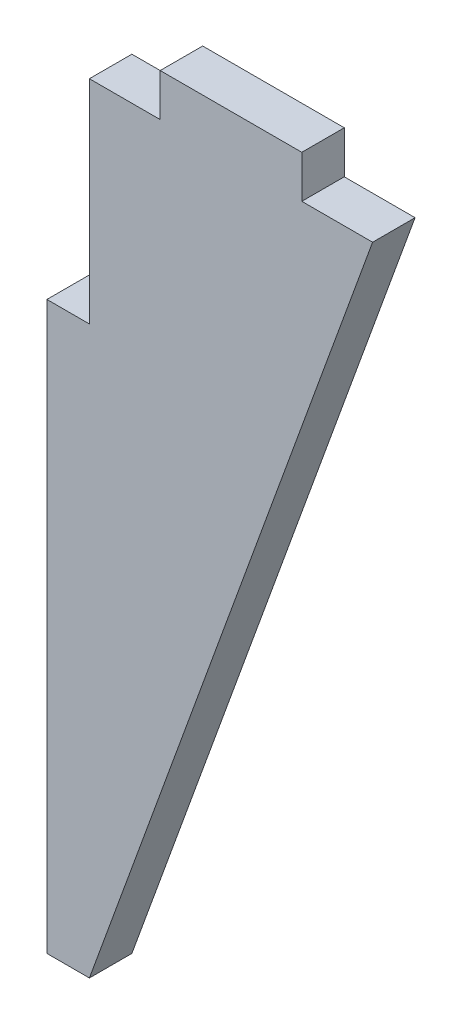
ISO-10303-21;
HEADER;
FILE_DESCRIPTION(('STEP AP214'),'2;1');
FILE_NAME('part.step','',(''),(''),'','','');
FILE_SCHEMA(('AUTOMOTIVE_DESIGN { 1 0 10303 214 1 1 1 1 }'));
ENDSEC;
DATA;
#1=APPLICATION_CONTEXT('core data for automotive mechanical design processes');
#2=APPLICATION_PROTOCOL_DEFINITION('international standard','automotive_design',2000,#1);
#3=PRODUCT_CONTEXT('',#1,'mechanical');
#4=PRODUCT('Part','Part','',(#3));
#5=PRODUCT_RELATED_PRODUCT_CATEGORY('part','',(#4));
#6=PRODUCT_DEFINITION_FORMATION('','',#4);
#7=PRODUCT_DEFINITION_CONTEXT('part definition',#1,'design');
#8=PRODUCT_DEFINITION('design','',#6,#7);
#9=PRODUCT_DEFINITION_SHAPE('','',#8);
#10=(LENGTH_UNIT() NAMED_UNIT(*) SI_UNIT(.MILLI.,.METRE.));
#11=(NAMED_UNIT(*) PLANE_ANGLE_UNIT() SI_UNIT($,.RADIAN.));
#12=(NAMED_UNIT(*) SI_UNIT($,.STERADIAN.) SOLID_ANGLE_UNIT());
#13=UNCERTAINTY_MEASURE_WITH_UNIT(LENGTH_MEASURE(1.E-05),#10,'distance_accuracy_value','');
#14=(GEOMETRIC_REPRESENTATION_CONTEXT(3) GLOBAL_UNCERTAINTY_ASSIGNED_CONTEXT((#13)) GLOBAL_UNIT_ASSIGNED_CONTEXT((#10,
#11,#12)) REPRESENTATION_CONTEXT('',''));
#15=CARTESIAN_POINT('',(0.,0.,0.));
#16=DIRECTION('',(0.,0.,1.));
#17=DIRECTION('',(1.,0.,0.));
#18=AXIS2_PLACEMENT_3D('',#15,#16,#17);
#19=CARTESIAN_POINT('',(-67.,-55.,65.393909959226));
#20=DIRECTION('',(-0.939793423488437,0.341743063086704,0.));
#21=DIRECTION('',(-0.341743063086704,-0.939793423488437,0.));
#22=AXIS2_PLACEMENT_3D('',#19,#20,#21);
#23=PLANE('',#22);
#24=DIRECTION('',(0.341743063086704,0.939793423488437,0.));
#25=VECTOR('',#24,1.);
#26=CARTESIAN_POINT('',(-67.,-55.,3.));
#27=LINE('',#26,#25);
#28=CARTESIAN_POINT('',(-67.,-55.,3.));
#29=VERTEX_POINT('',#28);
#30=CARTESIAN_POINT('',(-47.,0.,3.));
#31=VERTEX_POINT('',#30);
#32=EDGE_CURVE('E150',#29,#31,#27,.T.);
#33=ORIENTED_EDGE('',*,*,#32,.F.);
#34=DIRECTION('',(0.,0.,-1.));
#35=VECTOR('',#34,1.);
#36=CARTESIAN_POINT('',(-67.,-55.,65.393909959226));
#37=LINE('',#36,#35);
#38=CARTESIAN_POINT('',(-67.,-55.,0.));
#39=VERTEX_POINT('',#38);
#40=EDGE_CURVE('E37',#29,#39,#37,.T.);
#41=ORIENTED_EDGE('',*,*,#40,.T.);
#42=DIRECTION('',(0.341743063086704,0.939793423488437,0.));
#43=VECTOR('',#42,1.);
#44=CARTESIAN_POINT('',(-67.,-55.,0.));
#45=LINE('',#44,#43);
#46=CARTESIAN_POINT('',(-47.,0.,0.));
#47=VERTEX_POINT('',#46);
#48=EDGE_CURVE('E158',#39,#47,#45,.T.);
#49=ORIENTED_EDGE('',*,*,#48,.T.);
#50=DIRECTION('',(0.,0.,-1.));
#51=VECTOR('',#50,1.);
#52=CARTESIAN_POINT('',(-47.,0.,65.393909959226));
#53=LINE('',#52,#51);
#54=EDGE_CURVE('E96',#31,#47,#53,.T.);
#55=ORIENTED_EDGE('',*,*,#54,.F.);
#56=EDGE_LOOP('',(#33,#41,#49,#55));
#57=FACE_BOUND('',#56,.T.);
#58=ADVANCED_FACE('F33',(#57),#23,.F.);
#59=CARTESIAN_POINT('',(-47.,0.,65.393909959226));
#60=DIRECTION('',(0.,-1.,0.));
#61=DIRECTION('',(1.,0.,0.));
#62=AXIS2_PLACEMENT_3D('',#59,#60,#61);
#63=PLANE('',#62);
#64=DIRECTION('',(-1.,0.,0.));
#65=VECTOR('',#64,1.);
#66=CARTESIAN_POINT('',(-47.,0.,3.));
#67=LINE('',#66,#65);
#68=CARTESIAN_POINT('',(-52.,0.,3.));
#69=VERTEX_POINT('',#68);
#70=EDGE_CURVE('E103',#31,#69,#67,.T.);
#71=ORIENTED_EDGE('',*,*,#70,.F.);
#72=ORIENTED_EDGE('',*,*,#54,.T.);
#73=DIRECTION('',(-1.,0.,0.));
#74=VECTOR('',#73,1.);
#75=CARTESIAN_POINT('',(-47.,0.,0.));
#76=LINE('',#75,#74);
#77=CARTESIAN_POINT('',(-52.,0.,0.));
#78=VERTEX_POINT('',#77);
#79=EDGE_CURVE('E157',#47,#78,#76,.T.);
#80=ORIENTED_EDGE('',*,*,#79,.T.);
#81=DIRECTION('',(0.,0.,-1.));
#82=VECTOR('',#81,1.);
#83=CARTESIAN_POINT('',(-52.,0.,65.393909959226));
#84=LINE('',#83,#82);
#85=EDGE_CURVE('E159',#69,#78,#84,.T.);
#86=ORIENTED_EDGE('',*,*,#85,.F.);
#87=EDGE_LOOP('',(#71,#72,#80,#86));
#88=FACE_BOUND('',#87,.T.);
#89=ADVANCED_FACE('F198',(#88),#63,.F.);
#90=CARTESIAN_POINT('',(-52.,0.,65.393909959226));
#91=DIRECTION('',(-1.,0.,0.));
#92=DIRECTION('',(0.,0.,1.));
#93=AXIS2_PLACEMENT_3D('',#90,#91,#92);
#94=PLANE('',#93);
#95=DIRECTION('',(0.,1.,0.));
#96=VECTOR('',#95,1.);
#97=CARTESIAN_POINT('',(-52.,0.,3.));
#98=LINE('',#97,#96);
#99=CARTESIAN_POINT('',(-52.,3.,3.));
#100=VERTEX_POINT('',#99);
#101=EDGE_CURVE('E146',#69,#100,#98,.T.);
#102=ORIENTED_EDGE('',*,*,#101,.F.);
#103=ORIENTED_EDGE('',*,*,#85,.T.);
#104=DIRECTION('',(0.,1.,0.));
#105=VECTOR('',#104,1.);
#106=CARTESIAN_POINT('',(-52.,0.,0.));
#107=LINE('',#106,#105);
#108=CARTESIAN_POINT('',(-52.,3.,0.));
#109=VERTEX_POINT('',#108);
#110=EDGE_CURVE('E161',#78,#109,#107,.T.);
#111=ORIENTED_EDGE('',*,*,#110,.T.);
#112=DIRECTION('',(0.,0.,-1.));
#113=VECTOR('',#112,1.);
#114=CARTESIAN_POINT('',(-52.,3.,65.393909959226));
#115=LINE('',#114,#113);
#116=EDGE_CURVE('E162',#100,#109,#115,.T.);
#117=ORIENTED_EDGE('',*,*,#116,.F.);
#118=EDGE_LOOP('',(#102,#103,#111,#117));
#119=FACE_BOUND('',#118,.T.);
#120=ADVANCED_FACE('F201',(#119),#94,.F.);
#121=CARTESIAN_POINT('',(-52.,3.,65.393909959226));
#122=DIRECTION('',(0.,-1.,0.));
#123=DIRECTION('',(1.,0.,0.));
#124=AXIS2_PLACEMENT_3D('',#121,#122,#123);
#125=PLANE('',#124);
#126=DIRECTION('',(-1.,0.,0.));
#127=VECTOR('',#126,1.);
#128=CARTESIAN_POINT('',(-52.,3.,3.));
#129=LINE('',#128,#127);
#130=CARTESIAN_POINT('',(-62.,3.,3.));
#131=VERTEX_POINT('',#130);
#132=EDGE_CURVE('E143',#100,#131,#129,.T.);
#133=ORIENTED_EDGE('',*,*,#132,.F.);
#134=ORIENTED_EDGE('',*,*,#116,.T.);
#135=DIRECTION('',(-1.,0.,0.));
#136=VECTOR('',#135,1.);
#137=CARTESIAN_POINT('',(-52.,3.,0.));
#138=LINE('',#137,#136);
#139=CARTESIAN_POINT('',(-62.,3.,0.));
#140=VERTEX_POINT('',#139);
#141=EDGE_CURVE('E164',#109,#140,#138,.T.);
#142=ORIENTED_EDGE('',*,*,#141,.T.);
#143=DIRECTION('',(0.,0.,-1.));
#144=VECTOR('',#143,1.);
#145=CARTESIAN_POINT('',(-62.,3.,65.393909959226));
#146=LINE('',#145,#144);
#147=EDGE_CURVE('E165',#131,#140,#146,.T.);
#148=ORIENTED_EDGE('',*,*,#147,.F.);
#149=EDGE_LOOP('',(#133,#134,#142,#148));
#150=FACE_BOUND('',#149,.T.);
#151=ADVANCED_FACE('F203',(#150),#125,.F.);
#152=CARTESIAN_POINT('',(-62.,3.,65.393909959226));
#153=DIRECTION('',(1.,0.,0.));
#154=DIRECTION('',(0.,0.,-1.));
#155=AXIS2_PLACEMENT_3D('',#152,#153,#154);
#156=PLANE('',#155);
#157=DIRECTION('',(0.,-1.,0.));
#158=VECTOR('',#157,1.);
#159=CARTESIAN_POINT('',(-62.,3.,3.));
#160=LINE('',#159,#158);
#161=CARTESIAN_POINT('',(-62.,0.,3.));
#162=VERTEX_POINT('',#161);
#163=EDGE_CURVE('E140',#131,#162,#160,.T.);
#164=ORIENTED_EDGE('',*,*,#163,.F.);
#165=ORIENTED_EDGE('',*,*,#147,.T.);
#166=DIRECTION('',(0.,-1.,0.));
#167=VECTOR('',#166,1.);
#168=CARTESIAN_POINT('',(-62.,3.,0.));
#169=LINE('',#168,#167);
#170=CARTESIAN_POINT('',(-62.,0.,0.));
#171=VERTEX_POINT('',#170);
#172=EDGE_CURVE('E167',#140,#171,#169,.T.);
#173=ORIENTED_EDGE('',*,*,#172,.T.);
#174=DIRECTION('',(0.,0.,-1.));
#175=VECTOR('',#174,1.);
#176=CARTESIAN_POINT('',(-62.,0.,65.393909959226));
#177=LINE('',#176,#175);
#178=EDGE_CURVE('E168',#162,#171,#177,.T.);
#179=ORIENTED_EDGE('',*,*,#178,.F.);
#180=EDGE_LOOP('',(#164,#165,#173,#179));
#181=FACE_BOUND('',#180,.T.);
#182=ADVANCED_FACE('F207',(#181),#156,.F.);
#183=CARTESIAN_POINT('',(-62.,0.,65.393909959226));
#184=DIRECTION('',(0.,-1.,0.));
#185=DIRECTION('',(1.,0.,0.));
#186=AXIS2_PLACEMENT_3D('',#183,#184,#185);
#187=PLANE('',#186);
#188=DIRECTION('',(-1.,0.,0.));
#189=VECTOR('',#188,1.);
#190=CARTESIAN_POINT('',(-62.,0.,3.));
#191=LINE('',#190,#189);
#192=CARTESIAN_POINT('',(-67.,0.,3.));
#193=VERTEX_POINT('',#192);
#194=EDGE_CURVE('E135',#162,#193,#191,.T.);
#195=ORIENTED_EDGE('',*,*,#194,.F.);
#196=ORIENTED_EDGE('',*,*,#178,.T.);
#197=DIRECTION('',(-1.,0.,0.));
#198=VECTOR('',#197,1.);
#199=CARTESIAN_POINT('',(-62.,0.,0.));
#200=LINE('',#199,#198);
#201=CARTESIAN_POINT('',(-67.,0.,0.));
#202=VERTEX_POINT('',#201);
#203=EDGE_CURVE('E170',#171,#202,#200,.T.);
#204=ORIENTED_EDGE('',*,*,#203,.T.);
#205=DIRECTION('',(0.,0.,-1.));
#206=VECTOR('',#205,1.);
#207=CARTESIAN_POINT('',(-67.,0.,65.393909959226));
#208=LINE('',#207,#206);
#209=EDGE_CURVE('E171',#193,#202,#208,.T.);
#210=ORIENTED_EDGE('',*,*,#209,.F.);
#211=EDGE_LOOP('',(#195,#196,#204,#210));
#212=FACE_BOUND('',#211,.T.);
#213=ADVANCED_FACE('F212',(#212),#187,.F.);
#214=CARTESIAN_POINT('',(-67.,-15.,65.393909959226));
#215=DIRECTION('',(1.,0.,0.));
#216=DIRECTION('',(0.,0.,-1.));
#217=AXIS2_PLACEMENT_3D('',#214,#215,#216);
#218=PLANE('',#217);
#219=DIRECTION('',(0.,-1.,0.));
#220=VECTOR('',#219,1.);
#221=CARTESIAN_POINT('',(-67.,-15.,3.));
#222=LINE('',#221,#220);
#223=CARTESIAN_POINT('',(-67.,-15.,3.));
#224=VERTEX_POINT('',#223);
#225=EDGE_CURVE('E133',#193,#224,#222,.T.);
#226=ORIENTED_EDGE('',*,*,#225,.F.);
#227=ORIENTED_EDGE('',*,*,#209,.T.);
#228=DIRECTION('',(0.,-1.,0.));
#229=VECTOR('',#228,1.);
#230=CARTESIAN_POINT('',(-67.,-15.,0.));
#231=LINE('',#230,#229);
#232=CARTESIAN_POINT('',(-67.,-15.,0.));
#233=VERTEX_POINT('',#232);
#234=EDGE_CURVE('E173',#202,#233,#231,.T.);
#235=ORIENTED_EDGE('',*,*,#234,.T.);
#236=DIRECTION('',(0.,0.,-1.));
#237=VECTOR('',#236,1.);
#238=CARTESIAN_POINT('',(-67.,-15.,65.393909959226));
#239=LINE('',#238,#237);
#240=EDGE_CURVE('E174',#224,#233,#239,.T.);
#241=ORIENTED_EDGE('',*,*,#240,.F.);
#242=EDGE_LOOP('',(#226,#227,#235,#241));
#243=FACE_BOUND('',#242,.T.);
#244=ADVANCED_FACE('F215',(#243),#218,.F.);
#245=CARTESIAN_POINT('',(-67.,-15.,65.393909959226));
#246=DIRECTION('',(0.,-1.,0.));
#247=DIRECTION('',(1.,0.,0.));
#248=AXIS2_PLACEMENT_3D('',#245,#246,#247);
#249=PLANE('',#248);
#250=DIRECTION('',(-1.,0.,0.));
#251=VECTOR('',#250,1.);
#252=CARTESIAN_POINT('',(-67.,-15.,3.));
#253=LINE('',#252,#251);
#254=CARTESIAN_POINT('',(-70.,-15.,3.));
#255=VERTEX_POINT('',#254);
#256=EDGE_CURVE('E42',#224,#255,#253,.T.);
#257=ORIENTED_EDGE('',*,*,#256,.F.);
#258=ORIENTED_EDGE('',*,*,#240,.T.);
#259=DIRECTION('',(-1.,0.,0.));
#260=VECTOR('',#259,1.);
#261=CARTESIAN_POINT('',(-67.,-15.,0.));
#262=LINE('',#261,#260);
#263=CARTESIAN_POINT('',(-70.,-15.,0.));
#264=VERTEX_POINT('',#263);
#265=EDGE_CURVE('E127',#233,#264,#262,.T.);
#266=ORIENTED_EDGE('',*,*,#265,.T.);
#267=DIRECTION('',(0.,0.,-1.));
#268=VECTOR('',#267,1.);
#269=CARTESIAN_POINT('',(-70.,-15.,65.393909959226));
#270=LINE('',#269,#268);
#271=EDGE_CURVE('E118',#255,#264,#270,.T.);
#272=ORIENTED_EDGE('',*,*,#271,.F.);
#273=EDGE_LOOP('',(#257,#258,#266,#272));
#274=FACE_BOUND('',#273,.T.);
#275=ADVANCED_FACE('F124',(#274),#249,.F.);
#276=CARTESIAN_POINT('',(-70.,-55.,65.393909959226));
#277=DIRECTION('',(1.,0.,0.));
#278=DIRECTION('',(0.,0.,-1.));
#279=AXIS2_PLACEMENT_3D('',#276,#277,#278);
#280=PLANE('',#279);
#281=DIRECTION('',(0.,-1.,0.));
#282=VECTOR('',#281,1.);
#283=CARTESIAN_POINT('',(-70.,-55.,3.));
#284=LINE('',#283,#282);
#285=CARTESIAN_POINT('',(-70.,-55.,3.));
#286=VERTEX_POINT('',#285);
#287=EDGE_CURVE('E11',#255,#286,#284,.T.);
#288=ORIENTED_EDGE('',*,*,#287,.F.);
#289=ORIENTED_EDGE('',*,*,#271,.T.);
#290=DIRECTION('',(0.,-1.,0.));
#291=VECTOR('',#290,1.);
#292=CARTESIAN_POINT('',(-70.,-55.,0.));
#293=LINE('',#292,#291);
#294=CARTESIAN_POINT('',(-70.,-55.,0.));
#295=VERTEX_POINT('',#294);
#296=EDGE_CURVE('E129',#264,#295,#293,.T.);
#297=ORIENTED_EDGE('',*,*,#296,.T.);
#298=DIRECTION('',(0.,0.,-1.));
#299=VECTOR('',#298,1.);
#300=CARTESIAN_POINT('',(-70.,-55.,65.393909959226));
#301=LINE('',#300,#299);
#302=EDGE_CURVE('E55',#286,#295,#301,.T.);
#303=ORIENTED_EDGE('',*,*,#302,.F.);
#304=EDGE_LOOP('',(#288,#289,#297,#303));
#305=FACE_BOUND('',#304,.T.);
#306=ADVANCED_FACE('F117',(#305),#280,.F.);
#307=CARTESIAN_POINT('',(-67.,-55.,65.393909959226));
#308=DIRECTION('',(0.,1.,0.));
#309=DIRECTION('',(0.,0.,1.));
#310=AXIS2_PLACEMENT_3D('',#307,#308,#309);
#311=PLANE('',#310);
#312=DIRECTION('',(1.,0.,0.));
#313=VECTOR('',#312,1.);
#314=CARTESIAN_POINT('',(-67.,-55.,3.));
#315=LINE('',#314,#313);
#316=EDGE_CURVE('E153',#286,#29,#315,.T.);
#317=ORIENTED_EDGE('',*,*,#316,.F.);
#318=ORIENTED_EDGE('',*,*,#302,.T.);
#319=DIRECTION('',(1.,0.,0.));
#320=VECTOR('',#319,1.);
#321=CARTESIAN_POINT('',(-67.,-55.,0.));
#322=LINE('',#321,#320);
#323=EDGE_CURVE('E155',#295,#39,#322,.T.);
#324=ORIENTED_EDGE('',*,*,#323,.T.);
#325=ORIENTED_EDGE('',*,*,#40,.F.);
#326=EDGE_LOOP('',(#317,#318,#324,#325));
#327=FACE_BOUND('',#326,.T.);
#328=ADVANCED_FACE('F193',(#327),#311,.F.);
#329=CARTESIAN_POINT('',(0.,0.,0.));
#330=DIRECTION('',(0.,0.,1.));
#331=DIRECTION('',(1.,0.,0.));
#332=AXIS2_PLACEMENT_3D('',#329,#330,#331);
#333=PLANE('',#332);
#334=ORIENTED_EDGE('',*,*,#48,.F.);
#335=ORIENTED_EDGE('',*,*,#323,.F.);
#336=ORIENTED_EDGE('',*,*,#296,.F.);
#337=ORIENTED_EDGE('',*,*,#265,.F.);
#338=ORIENTED_EDGE('',*,*,#234,.F.);
#339=ORIENTED_EDGE('',*,*,#203,.F.);
#340=ORIENTED_EDGE('',*,*,#172,.F.);
#341=ORIENTED_EDGE('',*,*,#141,.F.);
#342=ORIENTED_EDGE('',*,*,#110,.F.);
#343=ORIENTED_EDGE('',*,*,#79,.F.);
#344=EDGE_LOOP('',(#334,#335,#336,#337,#338,#339,#340,#341,#342,#343));
#345=FACE_BOUND('',#344,.T.);
#346=ADVANCED_FACE('F195',(#345),#333,.F.);
#347=CARTESIAN_POINT('',(-66.99995,-55.,3.));
#348=DIRECTION('',(0.,0.,1.));
#349=DIRECTION('',(0.,1.,0.));
#350=AXIS2_PLACEMENT_3D('',#347,#348,#349);
#351=PLANE('',#350);
#352=ORIENTED_EDGE('',*,*,#316,.T.);
#353=ORIENTED_EDGE('',*,*,#32,.T.);
#354=ORIENTED_EDGE('',*,*,#70,.T.);
#355=ORIENTED_EDGE('',*,*,#101,.T.);
#356=ORIENTED_EDGE('',*,*,#132,.T.);
#357=ORIENTED_EDGE('',*,*,#163,.T.);
#358=ORIENTED_EDGE('',*,*,#194,.T.);
#359=ORIENTED_EDGE('',*,*,#225,.T.);
#360=ORIENTED_EDGE('',*,*,#256,.T.);
#361=ORIENTED_EDGE('',*,*,#287,.T.);
#362=EDGE_LOOP('',(#352,#353,#354,#355,#356,#357,#358,#359,#360,#361));
#363=FACE_BOUND('',#362,.T.);
#364=ADVANCED_FACE('F35',(#363),#351,.T.);
#365=CLOSED_SHELL('',(#58,#89,#120,#151,#182,#213,#244,#275,#306,#328,#346,#364));
#366=MANIFOLD_SOLID_BREP('B2',#365);
#367=ADVANCED_BREP_SHAPE_REPRESENTATION('',(#18,#366),#14);
#368=SHAPE_DEFINITION_REPRESENTATION(#9,#367);
ENDSEC;
END-ISO-10303-21;
